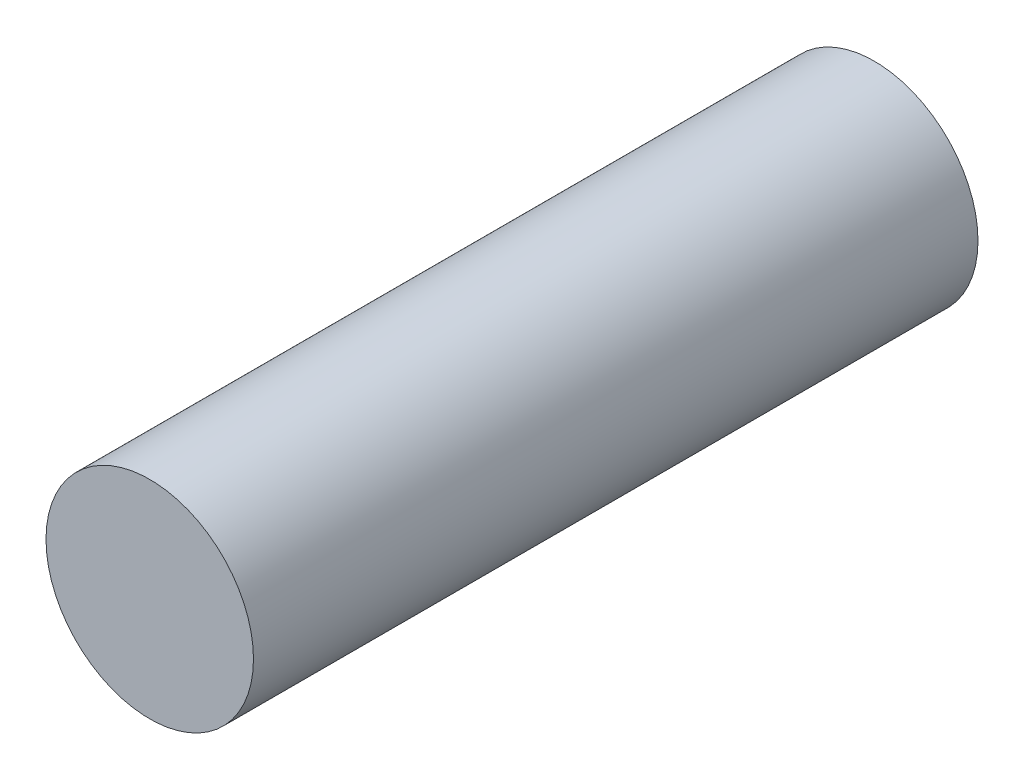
ISO-10303-21;
HEADER;
FILE_DESCRIPTION(('STEP AP214'),'2;1');
FILE_NAME('part.step','',(''),(''),'','','');
FILE_SCHEMA(('AUTOMOTIVE_DESIGN { 1 0 10303 214 1 1 1 1 }'));
ENDSEC;
DATA;
#1=APPLICATION_CONTEXT('core data for automotive mechanical design processes');
#2=APPLICATION_PROTOCOL_DEFINITION('international standard','automotive_design',2000,#1);
#3=PRODUCT_CONTEXT('',#1,'mechanical');
#4=PRODUCT('Part','Part','',(#3));
#5=PRODUCT_RELATED_PRODUCT_CATEGORY('part','',(#4));
#6=PRODUCT_DEFINITION_FORMATION('','',#4);
#7=PRODUCT_DEFINITION_CONTEXT('part definition',#1,'design');
#8=PRODUCT_DEFINITION('design','',#6,#7);
#9=PRODUCT_DEFINITION_SHAPE('','',#8);
#10=(LENGTH_UNIT() NAMED_UNIT(*) SI_UNIT(.MILLI.,.METRE.));
#11=(NAMED_UNIT(*) PLANE_ANGLE_UNIT() SI_UNIT($,.RADIAN.));
#12=(NAMED_UNIT(*) SI_UNIT($,.STERADIAN.) SOLID_ANGLE_UNIT());
#13=UNCERTAINTY_MEASURE_WITH_UNIT(LENGTH_MEASURE(1.E-05),#10,'distance_accuracy_value','');
#14=(GEOMETRIC_REPRESENTATION_CONTEXT(3) GLOBAL_UNCERTAINTY_ASSIGNED_CONTEXT((#13)) GLOBAL_UNIT_ASSIGNED_CONTEXT((#10,
#11,#12)) REPRESENTATION_CONTEXT('',''));
#15=CARTESIAN_POINT('',(0.,0.,0.));
#16=DIRECTION('',(0.,0.,1.));
#17=DIRECTION('',(1.,0.,0.));
#18=AXIS2_PLACEMENT_3D('',#15,#16,#17);
#19=CARTESIAN_POINT('',(0.,0.,27.94));
#20=DIRECTION('',(0.,0.,-1.));
#21=DIRECTION('',(-1.,0.,0.));
#22=AXIS2_PLACEMENT_3D('',#19,#20,#21);
#23=CYLINDRICAL_SURFACE('',#22,4.0005);
#24=CARTESIAN_POINT('',(0.,0.,27.94));
#25=DIRECTION('',(0.,0.,1.));
#26=DIRECTION('',(1.,0.,0.));
#27=AXIS2_PLACEMENT_3D('',#24,#25,#26);
#28=CIRCLE('',#27,4.0005);
#29=CARTESIAN_POINT('',(4.0005,0.,27.94));
#30=VERTEX_POINT('',#29);
#31=EDGE_CURVE('E10',#30,#30,#28,.T.);
#32=ORIENTED_EDGE('',*,*,#31,.F.);
#33=EDGE_LOOP('',(#32));
#34=FACE_BOUND('',#33,.T.);
#35=CARTESIAN_POINT('',(0.,0.,0.));
#36=DIRECTION('',(0.,0.,1.));
#37=DIRECTION('',(1.,0.,0.));
#38=AXIS2_PLACEMENT_3D('',#35,#36,#37);
#39=CIRCLE('',#38,4.0005);
#40=CARTESIAN_POINT('',(4.0005,0.,0.));
#41=VERTEX_POINT('',#40);
#42=EDGE_CURVE('E46',#41,#41,#39,.T.);
#43=ORIENTED_EDGE('',*,*,#42,.T.);
#44=EDGE_LOOP('',(#43));
#45=FACE_BOUND('',#44,.T.);
#46=ADVANCED_FACE('F43',(#34,#45),#23,.T.);
#47=CARTESIAN_POINT('',(0.,0.,27.94));
#48=DIRECTION('',(0.,0.,1.));
#49=DIRECTION('',(1.,0.,0.));
#50=AXIS2_PLACEMENT_3D('',#47,#48,#49);
#51=PLANE('',#50);
#52=ORIENTED_EDGE('',*,*,#31,.T.);
#53=EDGE_LOOP('',(#52));
#54=FACE_BOUND('',#53,.T.);
#55=ADVANCED_FACE('F60',(#54),#51,.T.);
#56=CARTESIAN_POINT('',(0.,0.,0.));
#57=DIRECTION('',(0.,0.,1.));
#58=DIRECTION('',(1.,0.,0.));
#59=AXIS2_PLACEMENT_3D('',#56,#57,#58);
#60=PLANE('',#59);
#61=ORIENTED_EDGE('',*,*,#42,.F.);
#62=EDGE_LOOP('',(#61));
#63=FACE_BOUND('',#62,.T.);
#64=ADVANCED_FACE('F58',(#63),#60,.F.);
#65=CLOSED_SHELL('',(#46,#55,#64));
#66=MANIFOLD_SOLID_BREP('B2',#65);
#67=ADVANCED_BREP_SHAPE_REPRESENTATION('',(#18,#66),#14);
#68=SHAPE_DEFINITION_REPRESENTATION(#9,#67);
ENDSEC;
END-ISO-10303-21;
